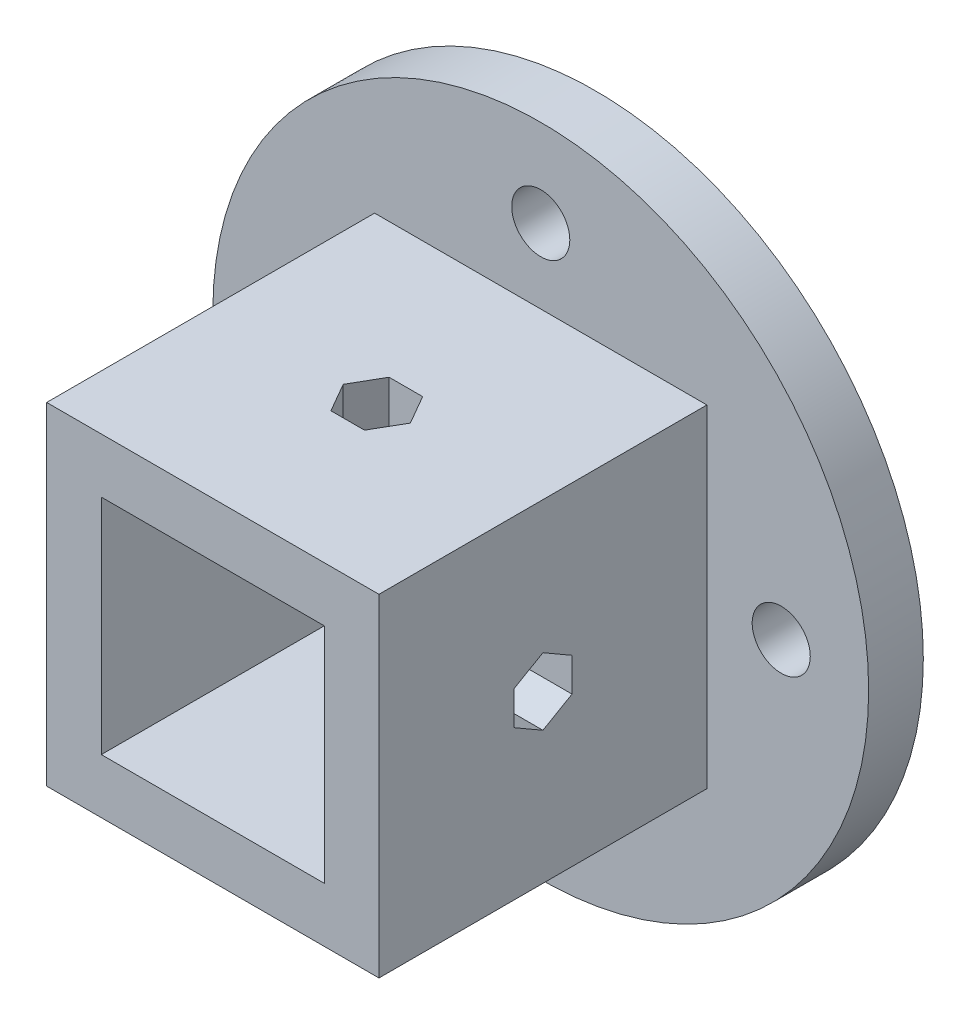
from build123d import *

# Parameters (mm, degrees)
SKETCH1_R               = 38.1
SKETCH1_R_2             = 3.375
SKETCH1_W               = 38.608
SKETCH1_H               = 38.608
BOSS_EXTRUDE1_DEPTH     = 6.35
SKETCH1_4_W             = 38.608
SKETCH1_4_H             = 38.608
SKETCH1_4_W_2           = 25.908
SKETCH1_4_H_2           = 25.908
BOSS_EXTRUDE2_DEPTH     = 44.45
CUT_EXTRUDE1_DEPTH      = 82.99165638
CUT_EXTRUDE1_DEPTH_BACK = 82.99165638
CUT_EXTRUDE3_DEPTH      = 82.99165638


with BuildPart() as part:
    # Sketch1 → Boss-Extrude1 (new body)
    with BuildSketch(Plane(origin=(0, 0, 0), x_dir=(0, 1, 0), z_dir=(0, 0, 1))):
        with Locations(Location((0, 0, 0), (0, 0, 270))):
            Circle(SKETCH1_R)
        with Locations(Location((-27.94, 0, 0), (0, 0, 270))):
            Circle(SKETCH1_R_2, mode=Mode.SUBTRACT)
        with Locations(Location((0, -27.94, 0), (0, 0, 270))):
            Circle(SKETCH1_R_2, mode=Mode.SUBTRACT)
        with Locations(Location((27.94, 0, 0), (0, 0, 270))):
            Circle(SKETCH1_R_2, mode=Mode.SUBTRACT)
        with Locations(Location((0, 27.94, 0), (0, 0, 270))):
            Circle(SKETCH1_R_2, mode=Mode.SUBTRACT)
        Rectangle(SKETCH1_W, SKETCH1_H, mode=Mode.SUBTRACT)
    extrude(amount=BOSS_EXTRUDE1_DEPTH)

    # Sketch1_4 → Boss-Extrude2 (add)
    with BuildSketch(Plane(origin=(0, 0, 0), x_dir=(0, 1, 0), z_dir=(0, 0, 1))):
        Rectangle(SKETCH1_4_W, SKETCH1_4_H)
        Rectangle(SKETCH1_4_W_2, SKETCH1_4_H_2, mode=Mode.SUBTRACT)
    extrude(amount=BOSS_EXTRUDE2_DEPTH)

    # Sketch3 → Cut-Extrude1 (cut, two sides: drawn at the far end of the back side and taken through both)
    with BuildSketch(Plane.XZ.offset(19.304).offset(-CUT_EXTRUDE1_DEPTH_BACK)):
        Polygon((1.950404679, 28.7782), (-1.950404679, 28.7782), (-3.900809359, 25.4), (-1.950404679, 22.0218), (1.950404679, 22.0218), (3.900809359, 25.4), align=None)
    extrude(amount=CUT_EXTRUDE1_DEPTH + CUT_EXTRUDE1_DEPTH_BACK, mode=Mode.SUBTRACT)

    # Sketch4 → Cut-Extrude3 (cut, through all)
    with BuildSketch(Plane.YZ.offset(19.304)):
        Polygon((1.950404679, 28.7782), (-1.950404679, 28.7782), (-3.900809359, 25.4), (-1.950404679, 22.0218), (1.950404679, 22.0218), (3.900809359, 25.4), align=None)
    extrude(amount=-CUT_EXTRUDE3_DEPTH, mode=Mode.SUBTRACT)


solid = part.part
